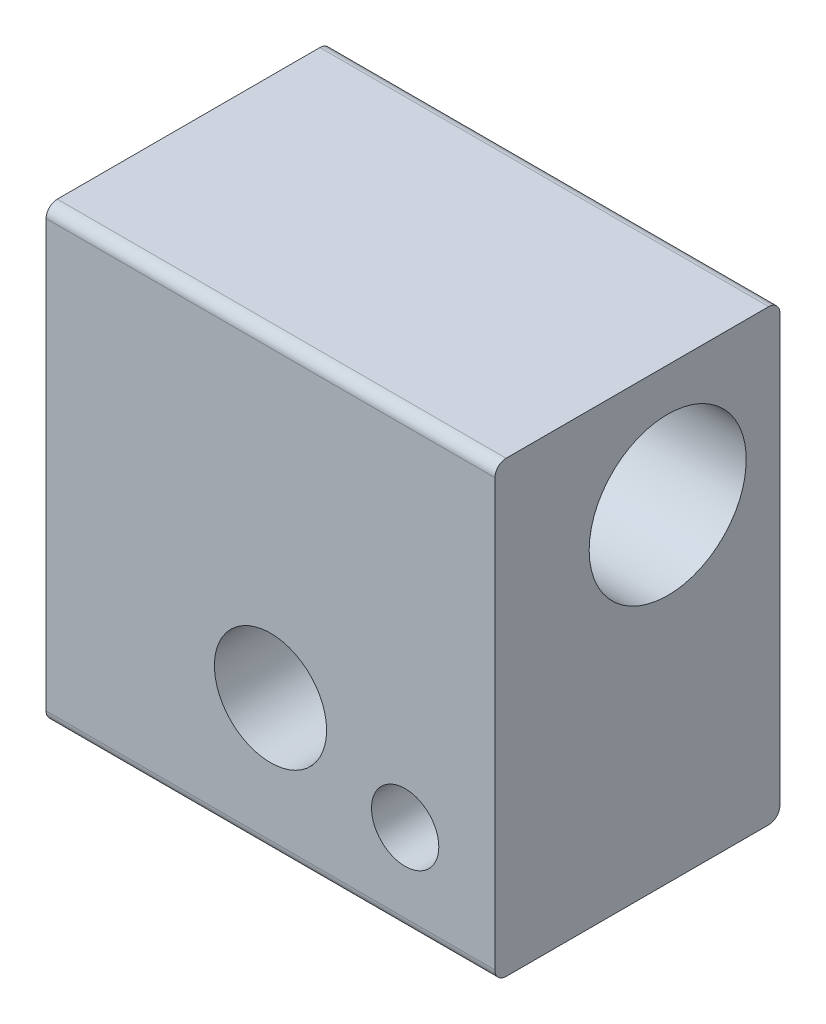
ISO-10303-21;
HEADER;
FILE_DESCRIPTION(('STEP AP214'),'2;1');
FILE_NAME('part.step','',(''),(''),'','','');
FILE_SCHEMA(('AUTOMOTIVE_DESIGN { 1 0 10303 214 1 1 1 1 }'));
ENDSEC;
DATA;
#1=APPLICATION_CONTEXT('core data for automotive mechanical design processes');
#2=APPLICATION_PROTOCOL_DEFINITION('international standard','automotive_design',2000,#1);
#3=PRODUCT_CONTEXT('',#1,'mechanical');
#4=PRODUCT('Part','Part','',(#3));
#5=PRODUCT_RELATED_PRODUCT_CATEGORY('part','',(#4));
#6=PRODUCT_DEFINITION_FORMATION('','',#4);
#7=PRODUCT_DEFINITION_CONTEXT('part definition',#1,'design');
#8=PRODUCT_DEFINITION('design','',#6,#7);
#9=PRODUCT_DEFINITION_SHAPE('','',#8);
#10=(LENGTH_UNIT() NAMED_UNIT(*) SI_UNIT(.MILLI.,.METRE.));
#11=(NAMED_UNIT(*) PLANE_ANGLE_UNIT() SI_UNIT($,.RADIAN.));
#12=(NAMED_UNIT(*) SI_UNIT($,.STERADIAN.) SOLID_ANGLE_UNIT());
#13=UNCERTAINTY_MEASURE_WITH_UNIT(LENGTH_MEASURE(1.E-05),#10,'distance_accuracy_value','');
#14=(GEOMETRIC_REPRESENTATION_CONTEXT(3) GLOBAL_UNCERTAINTY_ASSIGNED_CONTEXT((#13)) GLOBAL_UNIT_ASSIGNED_CONTEXT((#10,
#11,#12)) REPRESENTATION_CONTEXT('',''));
#15=CARTESIAN_POINT('',(0.,0.,0.));
#16=DIRECTION('',(0.,0.,1.));
#17=DIRECTION('',(1.,0.,0.));
#18=AXIS2_PLACEMENT_3D('',#15,#16,#17);
#19=CARTESIAN_POINT('',(16.,4.,-6.));
#20=DIRECTION('',(0.,0.,1.));
#21=DIRECTION('',(1.,0.,0.));
#22=AXIS2_PLACEMENT_3D('',#19,#20,#21);
#23=PLANE('',#22);
#24=CARTESIAN_POINT('',(16.,4.,-6.));
#25=DIRECTION('',(0.,0.,1.));
#26=DIRECTION('',(1.,0.,0.));
#27=AXIS2_PLACEMENT_3D('',#24,#25,#26);
#28=CIRCLE('',#27,1.5);
#29=CARTESIAN_POINT('',(17.5,4.,-6.));
#30=VERTEX_POINT('',#29);
#31=EDGE_CURVE('E20',#30,#30,#28,.T.);
#32=ORIENTED_EDGE('',*,*,#31,.T.);
#33=EDGE_LOOP('',(#32));
#34=FACE_BOUND('',#33,.T.);
#35=ADVANCED_FACE('F17',(#34),#23,.T.);
#36=CARTESIAN_POINT('',(16.,4.,-6.));
#37=DIRECTION('',(0.,0.,1.));
#38=DIRECTION('',(1.,0.,0.));
#39=AXIS2_PLACEMENT_3D('',#36,#37,#38);
#40=CYLINDRICAL_SURFACE('',#39,1.5);
#41=ORIENTED_EDGE('',*,*,#31,.F.);
#42=EDGE_LOOP('',(#41));
#43=FACE_BOUND('',#42,.T.);
#44=CARTESIAN_POINT('',(16.,4.,0.));
#45=DIRECTION('',(0.,0.,1.));
#46=DIRECTION('',(1.,0.,0.));
#47=AXIS2_PLACEMENT_3D('',#44,#45,#46);
#48=CIRCLE('',#47,1.5);
#49=CARTESIAN_POINT('',(17.5,4.,0.));
#50=VERTEX_POINT('',#49);
#51=EDGE_CURVE('E167',#50,#50,#48,.T.);
#52=ORIENTED_EDGE('',*,*,#51,.T.);
#53=EDGE_LOOP('',(#52));
#54=FACE_BOUND('',#53,.T.);
#55=ADVANCED_FACE('F155',(#43,#54),#40,.F.);
#56=CARTESIAN_POINT('',(20.,0.5,-0.5));
#57=DIRECTION('',(-1.,0.,0.));
#58=DIRECTION('',(0.,0.,1.));
#59=AXIS2_PLACEMENT_3D('',#56,#57,#58);
#60=CYLINDRICAL_SURFACE('',#59,0.5);
#61=CARTESIAN_POINT('',(20.,0.5,-0.5));
#62=DIRECTION('',(-1.,0.,0.));
#63=DIRECTION('',(0.,0.,1.));
#64=AXIS2_PLACEMENT_3D('',#61,#62,#63);
#65=CIRCLE('',#64,0.5);
#66=CARTESIAN_POINT('',(20.,0.,-0.500000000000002));
#67=VERTEX_POINT('',#66);
#68=CARTESIAN_POINT('',(20.,0.500000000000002,0.));
#69=VERTEX_POINT('',#68);
#70=EDGE_CURVE('E183',#67,#69,#65,.T.);
#71=ORIENTED_EDGE('',*,*,#70,.T.);
#72=DIRECTION('',(-1.,0.,0.));
#73=VECTOR('',#72,1.);
#74=CARTESIAN_POINT('',(20.,0.500000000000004,0.));
#75=LINE('',#74,#73);
#76=CARTESIAN_POINT('',(0.,0.500000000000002,0.));
#77=VERTEX_POINT('',#76);
#78=EDGE_CURVE('E173',#69,#77,#75,.T.);
#79=ORIENTED_EDGE('',*,*,#78,.T.);
#80=CARTESIAN_POINT('',(0.,0.5,-0.5));
#81=DIRECTION('',(-1.,0.,0.));
#82=DIRECTION('',(0.,0.,1.));
#83=AXIS2_PLACEMENT_3D('',#80,#81,#82);
#84=CIRCLE('',#83,0.5);
#85=CARTESIAN_POINT('',(0.,0.,-0.500000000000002));
#86=VERTEX_POINT('',#85);
#87=EDGE_CURVE('E74',#77,#86,#84,.F.);
#88=ORIENTED_EDGE('',*,*,#87,.T.);
#89=DIRECTION('',(1.,0.,0.));
#90=VECTOR('',#89,1.);
#91=CARTESIAN_POINT('',(20.,0.,-0.500000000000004));
#92=LINE('',#91,#90);
#93=EDGE_CURVE('E170',#86,#67,#92,.T.);
#94=ORIENTED_EDGE('',*,*,#93,.T.);
#95=EDGE_LOOP('',(#71,#79,#88,#94));
#96=FACE_BOUND('',#95,.T.);
#97=ADVANCED_FACE('F152',(#96),#60,.T.);
#98=CARTESIAN_POINT('',(20.,19.5,-0.5));
#99=DIRECTION('',(-1.,0.,0.));
#100=DIRECTION('',(0.,0.,1.));
#101=AXIS2_PLACEMENT_3D('',#98,#99,#100);
#102=CYLINDRICAL_SURFACE('',#101,0.5);
#103=CARTESIAN_POINT('',(20.,19.5,-0.5));
#104=DIRECTION('',(-1.,0.,0.));
#105=DIRECTION('',(0.,0.,1.));
#106=AXIS2_PLACEMENT_3D('',#103,#104,#105);
#107=CIRCLE('',#106,0.5);
#108=CARTESIAN_POINT('',(20.,19.5,0.));
#109=VERTEX_POINT('',#108);
#110=CARTESIAN_POINT('',(20.,20.,-0.500000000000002));
#111=VERTEX_POINT('',#110);
#112=EDGE_CURVE('E175',#109,#111,#107,.T.);
#113=ORIENTED_EDGE('',*,*,#112,.T.);
#114=DIRECTION('',(1.,0.,0.));
#115=VECTOR('',#114,1.);
#116=CARTESIAN_POINT('',(20.,20.,-0.500000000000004));
#117=LINE('',#116,#115);
#118=CARTESIAN_POINT('',(0.,20.,-0.500000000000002));
#119=VERTEX_POINT('',#118);
#120=EDGE_CURVE('E195',#111,#119,#117,.F.);
#121=ORIENTED_EDGE('',*,*,#120,.T.);
#122=CARTESIAN_POINT('',(0.,19.5,-0.5));
#123=DIRECTION('',(-1.,0.,0.));
#124=DIRECTION('',(0.,0.,1.));
#125=AXIS2_PLACEMENT_3D('',#122,#123,#124);
#126=CIRCLE('',#125,0.5);
#127=CARTESIAN_POINT('',(0.,19.5,0.));
#128=VERTEX_POINT('',#127);
#129=EDGE_CURVE('E107',#119,#128,#126,.F.);
#130=ORIENTED_EDGE('',*,*,#129,.T.);
#131=DIRECTION('',(-1.,0.,0.));
#132=VECTOR('',#131,1.);
#133=CARTESIAN_POINT('',(20.,19.5,0.));
#134=LINE('',#133,#132);
#135=EDGE_CURVE('E169',#128,#109,#134,.F.);
#136=ORIENTED_EDGE('',*,*,#135,.T.);
#137=EDGE_LOOP('',(#113,#121,#130,#136));
#138=FACE_BOUND('',#137,.T.);
#139=ADVANCED_FACE('F148',(#138),#102,.T.);
#140=CARTESIAN_POINT('',(20.,0.,-0.500000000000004));
#141=DIRECTION('',(0.,1.,0.));
#142=DIRECTION('',(0.,0.,1.));
#143=AXIS2_PLACEMENT_3D('',#140,#141,#142);
#144=PLANE('',#143);
#145=DIRECTION('',(-1.,0.,0.));
#146=VECTOR('',#145,1.);
#147=CARTESIAN_POINT('',(20.,0.,-12.2));
#148=LINE('',#147,#146);
#149=CARTESIAN_POINT('',(20.,0.,-12.2));
#150=VERTEX_POINT('',#149);
#151=CARTESIAN_POINT('',(0.,0.,-12.2));
#152=VERTEX_POINT('',#151);
#153=EDGE_CURVE('E84',#150,#152,#148,.T.);
#154=ORIENTED_EDGE('',*,*,#153,.F.);
#155=DIRECTION('',(0.,0.,1.));
#156=VECTOR('',#155,1.);
#157=CARTESIAN_POINT('',(20.,0.,-12.2));
#158=LINE('',#157,#156);
#159=EDGE_CURVE('E199',#150,#67,#158,.T.);
#160=ORIENTED_EDGE('',*,*,#159,.T.);
#161=ORIENTED_EDGE('',*,*,#93,.F.);
#162=DIRECTION('',(0.,0.,1.));
#163=VECTOR('',#162,1.);
#164=CARTESIAN_POINT('',(0.,0.,-12.2));
#165=LINE('',#164,#163);
#166=EDGE_CURVE('E104',#152,#86,#165,.T.);
#167=ORIENTED_EDGE('',*,*,#166,.F.);
#168=EDGE_LOOP('',(#154,#160,#161,#167));
#169=FACE_BOUND('',#168,.T.);
#170=ADVANCED_FACE('F144',(#169),#144,.F.);
#171=CARTESIAN_POINT('',(20.,0.500000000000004,0.));
#172=DIRECTION('',(0.,0.,-1.));
#173=DIRECTION('',(-1.,0.,0.));
#174=AXIS2_PLACEMENT_3D('',#171,#172,#173);
#175=PLANE('',#174);
#176=ORIENTED_EDGE('',*,*,#78,.F.);
#177=DIRECTION('',(0.,1.,0.));
#178=VECTOR('',#177,1.);
#179=CARTESIAN_POINT('',(20.,19.5,0.));
#180=LINE('',#179,#178);
#181=EDGE_CURVE('E193',#69,#109,#180,.T.);
#182=ORIENTED_EDGE('',*,*,#181,.T.);
#183=ORIENTED_EDGE('',*,*,#135,.F.);
#184=DIRECTION('',(0.,1.,0.));
#185=VECTOR('',#184,1.);
#186=CARTESIAN_POINT('',(0.,19.5,0.));
#187=LINE('',#186,#185);
#188=EDGE_CURVE('E194',#77,#128,#187,.T.);
#189=ORIENTED_EDGE('',*,*,#188,.F.);
#190=EDGE_LOOP('',(#176,#182,#183,#189));
#191=FACE_BOUND('',#190,.T.);
#192=CARTESIAN_POINT('',(10.,6.,0.));
#193=DIRECTION('',(0.,0.,1.));
#194=DIRECTION('',(1.,0.,0.));
#195=AXIS2_PLACEMENT_3D('',#192,#193,#194);
#196=CIRCLE('',#195,2.5);
#197=CARTESIAN_POINT('',(12.5,6.,0.));
#198=VERTEX_POINT('',#197);
#199=EDGE_CURVE('E179',#198,#198,#196,.F.);
#200=ORIENTED_EDGE('',*,*,#199,.T.);
#201=EDGE_LOOP('',(#200));
#202=FACE_BOUND('',#201,.T.);
#203=ORIENTED_EDGE('',*,*,#51,.F.);
#204=EDGE_LOOP('',(#203));
#205=FACE_BOUND('',#204,.T.);
#206=ADVANCED_FACE('F140',(#191,#202,#205),#175,.F.);
#207=CARTESIAN_POINT('',(20.,20.,-0.500000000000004));
#208=DIRECTION('',(0.,-1.,0.));
#209=DIRECTION('',(0.,0.,-1.));
#210=AXIS2_PLACEMENT_3D('',#207,#208,#209);
#211=PLANE('',#210);
#212=ORIENTED_EDGE('',*,*,#120,.F.);
#213=DIRECTION('',(0.,0.,1.));
#214=VECTOR('',#213,1.);
#215=CARTESIAN_POINT('',(20.,20.,-12.2));
#216=LINE('',#215,#214);
#217=CARTESIAN_POINT('',(20.,20.,-12.2));
#218=VERTEX_POINT('',#217);
#219=EDGE_CURVE('E198',#111,#218,#216,.F.);
#220=ORIENTED_EDGE('',*,*,#219,.T.);
#221=DIRECTION('',(-1.,0.,0.));
#222=VECTOR('',#221,1.);
#223=CARTESIAN_POINT('',(20.,20.,-12.2));
#224=LINE('',#223,#222);
#225=CARTESIAN_POINT('',(0.,20.,-12.2));
#226=VERTEX_POINT('',#225);
#227=EDGE_CURVE('E210',#226,#218,#224,.F.);
#228=ORIENTED_EDGE('',*,*,#227,.F.);
#229=DIRECTION('',(0.,0.,1.));
#230=VECTOR('',#229,1.);
#231=CARTESIAN_POINT('',(0.,20.,-12.2));
#232=LINE('',#231,#230);
#233=EDGE_CURVE('E216',#119,#226,#232,.F.);
#234=ORIENTED_EDGE('',*,*,#233,.F.);
#235=EDGE_LOOP('',(#212,#220,#228,#234));
#236=FACE_BOUND('',#235,.T.);
#237=ADVANCED_FACE('F136',(#236),#211,.F.);
#238=CARTESIAN_POINT('',(20.,14.6,-7.7));
#239=DIRECTION('',(-1.,0.,0.));
#240=DIRECTION('',(0.,0.,1.));
#241=AXIS2_PLACEMENT_3D('',#238,#239,#240);
#242=CYLINDRICAL_SURFACE('',#241,3.5);
#243=CARTESIAN_POINT('',(20.,14.6,-7.7));
#244=DIRECTION('',(-1.,0.,0.));
#245=DIRECTION('',(0.,0.,1.));
#246=AXIS2_PLACEMENT_3D('',#243,#244,#245);
#247=CIRCLE('',#246,3.5);
#248=CARTESIAN_POINT('',(20.,14.6,-4.2));
#249=VERTEX_POINT('',#248);
#250=EDGE_CURVE('E202',#249,#249,#247,.F.);
#251=ORIENTED_EDGE('',*,*,#250,.T.);
#252=EDGE_LOOP('',(#251));
#253=FACE_BOUND('',#252,.T.);
#254=CARTESIAN_POINT('',(0.,14.6,-7.7));
#255=DIRECTION('',(-1.,0.,0.));
#256=DIRECTION('',(0.,0.,1.));
#257=AXIS2_PLACEMENT_3D('',#254,#255,#256);
#258=CIRCLE('',#257,3.5);
#259=CARTESIAN_POINT('',(0.,14.6,-4.2));
#260=VERTEX_POINT('',#259);
#261=EDGE_CURVE('E215',#260,#260,#258,.F.);
#262=ORIENTED_EDGE('',*,*,#261,.F.);
#263=EDGE_LOOP('',(#262));
#264=FACE_BOUND('',#263,.T.);
#265=ADVANCED_FACE('F132',(#253,#264),#242,.F.);
#266=CARTESIAN_POINT('',(10.,6.,-12.7));
#267=DIRECTION('',(0.,0.,1.));
#268=DIRECTION('',(1.,0.,0.));
#269=AXIS2_PLACEMENT_3D('',#266,#267,#268);
#270=CYLINDRICAL_SURFACE('',#269,2.5);
#271=CARTESIAN_POINT('',(10.,6.,-12.7));
#272=DIRECTION('',(0.,0.,1.));
#273=DIRECTION('',(1.,0.,0.));
#274=AXIS2_PLACEMENT_3D('',#271,#272,#273);
#275=CIRCLE('',#274,2.5);
#276=CARTESIAN_POINT('',(12.5,6.,-12.7));
#277=VERTEX_POINT('',#276);
#278=EDGE_CURVE('E99',#277,#277,#275,.F.);
#279=ORIENTED_EDGE('',*,*,#278,.T.);
#280=EDGE_LOOP('',(#279));
#281=FACE_BOUND('',#280,.T.);
#282=ORIENTED_EDGE('',*,*,#199,.F.);
#283=EDGE_LOOP('',(#282));
#284=FACE_BOUND('',#283,.T.);
#285=ADVANCED_FACE('F129',(#281,#284),#270,.F.);
#286=CARTESIAN_POINT('',(20.,0.5,-12.2));
#287=DIRECTION('',(-1.,0.,0.));
#288=DIRECTION('',(0.,0.,1.));
#289=AXIS2_PLACEMENT_3D('',#286,#287,#288);
#290=CYLINDRICAL_SURFACE('',#289,0.5);
#291=CARTESIAN_POINT('',(20.,0.5,-12.2));
#292=DIRECTION('',(-1.,0.,0.));
#293=DIRECTION('',(0.,0.,1.));
#294=AXIS2_PLACEMENT_3D('',#291,#292,#293);
#295=CIRCLE('',#294,0.5);
#296=CARTESIAN_POINT('',(20.,0.500000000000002,-12.7));
#297=VERTEX_POINT('',#296);
#298=EDGE_CURVE('E204',#297,#150,#295,.T.);
#299=ORIENTED_EDGE('',*,*,#298,.T.);
#300=ORIENTED_EDGE('',*,*,#153,.T.);
#301=CARTESIAN_POINT('',(0.,0.5,-12.2));
#302=DIRECTION('',(-1.,0.,0.));
#303=DIRECTION('',(0.,0.,1.));
#304=AXIS2_PLACEMENT_3D('',#301,#302,#303);
#305=CIRCLE('',#304,0.5);
#306=CARTESIAN_POINT('',(0.,0.500000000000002,-12.7));
#307=VERTEX_POINT('',#306);
#308=EDGE_CURVE('E101',#307,#152,#305,.T.);
#309=ORIENTED_EDGE('',*,*,#308,.F.);
#310=DIRECTION('',(1.,0.,0.));
#311=VECTOR('',#310,1.);
#312=CARTESIAN_POINT('',(20.,0.500000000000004,-12.7));
#313=LINE('',#312,#311);
#314=EDGE_CURVE('E92',#307,#297,#313,.T.);
#315=ORIENTED_EDGE('',*,*,#314,.T.);
#316=EDGE_LOOP('',(#299,#300,#309,#315));
#317=FACE_BOUND('',#316,.T.);
#318=ADVANCED_FACE('F102',(#317),#290,.T.);
#319=CARTESIAN_POINT('',(20.,19.5,-12.2));
#320=DIRECTION('',(-1.,0.,0.));
#321=DIRECTION('',(0.,0.,1.));
#322=AXIS2_PLACEMENT_3D('',#319,#320,#321);
#323=PLANE('',#322);
#324=ORIENTED_EDGE('',*,*,#250,.F.);
#325=EDGE_LOOP('',(#324));
#326=FACE_BOUND('',#325,.T.);
#327=ORIENTED_EDGE('',*,*,#219,.F.);
#328=ORIENTED_EDGE('',*,*,#112,.F.);
#329=ORIENTED_EDGE('',*,*,#181,.F.);
#330=ORIENTED_EDGE('',*,*,#70,.F.);
#331=ORIENTED_EDGE('',*,*,#159,.F.);
#332=ORIENTED_EDGE('',*,*,#298,.F.);
#333=DIRECTION('',(0.,1.,0.));
#334=VECTOR('',#333,1.);
#335=CARTESIAN_POINT('',(20.,0.500000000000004,-12.7));
#336=LINE('',#335,#334);
#337=CARTESIAN_POINT('',(20.,19.5,-12.7));
#338=VERTEX_POINT('',#337);
#339=EDGE_CURVE('E98',#297,#338,#336,.T.);
#340=ORIENTED_EDGE('',*,*,#339,.T.);
#341=CARTESIAN_POINT('',(20.,19.5,-12.2));
#342=DIRECTION('',(-1.,0.,0.));
#343=DIRECTION('',(0.,0.,1.));
#344=AXIS2_PLACEMENT_3D('',#341,#342,#343);
#345=CIRCLE('',#344,0.5);
#346=EDGE_CURVE('E212',#218,#338,#345,.T.);
#347=ORIENTED_EDGE('',*,*,#346,.F.);
#348=EDGE_LOOP('',(#327,#328,#329,#330,#331,#332,#340,#347));
#349=FACE_BOUND('',#348,.T.);
#350=ADVANCED_FACE('F119',(#326,#349),#323,.F.);
#351=CARTESIAN_POINT('',(20.,19.5,-12.2));
#352=DIRECTION('',(-1.,0.,0.));
#353=DIRECTION('',(0.,0.,1.));
#354=AXIS2_PLACEMENT_3D('',#351,#352,#353);
#355=CYLINDRICAL_SURFACE('',#354,0.5);
#356=ORIENTED_EDGE('',*,*,#346,.T.);
#357=DIRECTION('',(1.,0.,0.));
#358=VECTOR('',#357,1.);
#359=CARTESIAN_POINT('',(20.,19.5,-12.7));
#360=LINE('',#359,#358);
#361=CARTESIAN_POINT('',(0.,19.5,-12.7));
#362=VERTEX_POINT('',#361);
#363=EDGE_CURVE('E26',#338,#362,#360,.F.);
#364=ORIENTED_EDGE('',*,*,#363,.T.);
#365=CARTESIAN_POINT('',(0.,19.5,-12.2));
#366=DIRECTION('',(-1.,0.,0.));
#367=DIRECTION('',(0.,0.,1.));
#368=AXIS2_PLACEMENT_3D('',#365,#366,#367);
#369=CIRCLE('',#368,0.5);
#370=EDGE_CURVE('E34',#226,#362,#369,.T.);
#371=ORIENTED_EDGE('',*,*,#370,.F.);
#372=ORIENTED_EDGE('',*,*,#227,.T.);
#373=EDGE_LOOP('',(#356,#364,#371,#372));
#374=FACE_BOUND('',#373,.T.);
#375=ADVANCED_FACE('F110',(#374),#355,.T.);
#376=CARTESIAN_POINT('',(0.,19.5,-12.2));
#377=DIRECTION('',(-1.,0.,0.));
#378=DIRECTION('',(0.,0.,1.));
#379=AXIS2_PLACEMENT_3D('',#376,#377,#378);
#380=PLANE('',#379);
#381=ORIENTED_EDGE('',*,*,#261,.T.);
#382=EDGE_LOOP('',(#381));
#383=FACE_BOUND('',#382,.T.);
#384=ORIENTED_EDGE('',*,*,#129,.F.);
#385=ORIENTED_EDGE('',*,*,#233,.T.);
#386=ORIENTED_EDGE('',*,*,#370,.T.);
#387=DIRECTION('',(0.,1.,0.));
#388=VECTOR('',#387,1.);
#389=CARTESIAN_POINT('',(0.,0.500000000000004,-12.7));
#390=LINE('',#389,#388);
#391=EDGE_CURVE('E11',#362,#307,#390,.F.);
#392=ORIENTED_EDGE('',*,*,#391,.T.);
#393=ORIENTED_EDGE('',*,*,#308,.T.);
#394=ORIENTED_EDGE('',*,*,#166,.T.);
#395=ORIENTED_EDGE('',*,*,#87,.F.);
#396=ORIENTED_EDGE('',*,*,#188,.T.);
#397=EDGE_LOOP('',(#384,#385,#386,#392,#393,#394,#395,#396));
#398=FACE_BOUND('',#397,.T.);
#399=ADVANCED_FACE('F106',(#383,#398),#380,.T.);
#400=CARTESIAN_POINT('',(20.,0.500000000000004,-12.7));
#401=DIRECTION('',(0.,0.,1.));
#402=DIRECTION('',(1.,0.,0.));
#403=AXIS2_PLACEMENT_3D('',#400,#401,#402);
#404=PLANE('',#403);
#405=ORIENTED_EDGE('',*,*,#363,.F.);
#406=ORIENTED_EDGE('',*,*,#339,.F.);
#407=ORIENTED_EDGE('',*,*,#314,.F.);
#408=ORIENTED_EDGE('',*,*,#391,.F.);
#409=EDGE_LOOP('',(#405,#406,#407,#408));
#410=FACE_BOUND('',#409,.T.);
#411=ORIENTED_EDGE('',*,*,#278,.F.);
#412=EDGE_LOOP('',(#411));
#413=FACE_BOUND('',#412,.T.);
#414=ADVANCED_FACE('F94',(#410,#413),#404,.F.);
#415=CLOSED_SHELL('',(#35,#55,#97,#139,#170,#206,#237,#265,#285,#318,#350,#375,#399,#414));
#416=MANIFOLD_SOLID_BREP('B1',#415);
#417=ADVANCED_BREP_SHAPE_REPRESENTATION('',(#18,#416),#14);
#418=SHAPE_DEFINITION_REPRESENTATION(#9,#417);
ENDSEC;
END-ISO-10303-21;
